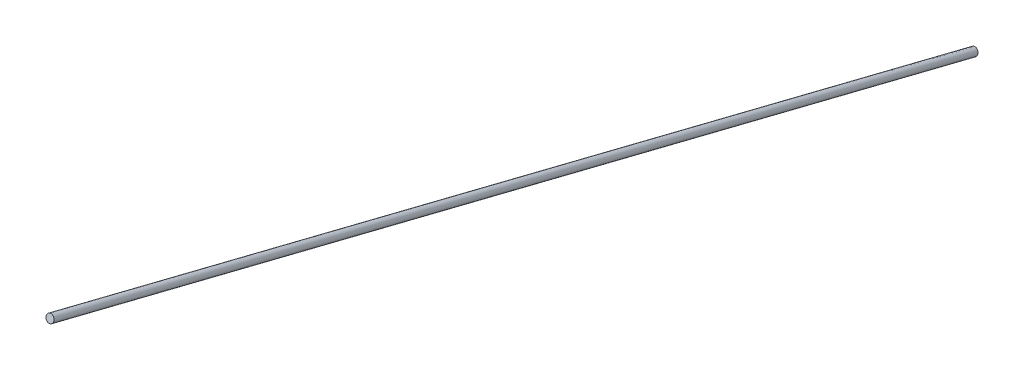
ISO-10303-21;
HEADER;
FILE_DESCRIPTION(('STEP AP214'),'2;1');
FILE_NAME('part.step','',(''),(''),'','','');
FILE_SCHEMA(('AUTOMOTIVE_DESIGN { 1 0 10303 214 1 1 1 1 }'));
ENDSEC;
DATA;
#1=APPLICATION_CONTEXT('core data for automotive mechanical design processes');
#2=APPLICATION_PROTOCOL_DEFINITION('international standard','automotive_design',2000,#1);
#3=PRODUCT_CONTEXT('',#1,'mechanical');
#4=PRODUCT('Part','Part','',(#3));
#5=PRODUCT_RELATED_PRODUCT_CATEGORY('part','',(#4));
#6=PRODUCT_DEFINITION_FORMATION('','',#4);
#7=PRODUCT_DEFINITION_CONTEXT('part definition',#1,'design');
#8=PRODUCT_DEFINITION('design','',#6,#7);
#9=PRODUCT_DEFINITION_SHAPE('','',#8);
#10=(LENGTH_UNIT() NAMED_UNIT(*) SI_UNIT(.MILLI.,.METRE.));
#11=(NAMED_UNIT(*) PLANE_ANGLE_UNIT() SI_UNIT($,.RADIAN.));
#12=(NAMED_UNIT(*) SI_UNIT($,.STERADIAN.) SOLID_ANGLE_UNIT());
#13=UNCERTAINTY_MEASURE_WITH_UNIT(LENGTH_MEASURE(1.E-05),#10,'distance_accuracy_value','');
#14=(GEOMETRIC_REPRESENTATION_CONTEXT(3) GLOBAL_UNCERTAINTY_ASSIGNED_CONTEXT((#13)) GLOBAL_UNIT_ASSIGNED_CONTEXT((#10,
#11,#12)) REPRESENTATION_CONTEXT('',''));
#15=CARTESIAN_POINT('',(0.,0.,0.));
#16=DIRECTION('',(0.,0.,1.));
#17=DIRECTION('',(1.,0.,0.));
#18=AXIS2_PLACEMENT_3D('',#15,#16,#17);
#19=CARTESIAN_POINT('',(0.3876059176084,22.03070653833,139.0767693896));
#20=DIRECTION('',(0.,0.242347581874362,0.970189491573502));
#21=DIRECTION('',(0.,0.970189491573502,-0.242347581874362));
#22=AXIS2_PLACEMENT_3D('',#19,#20,#21);
#23=PLANE('',#22);
#24=CARTESIAN_POINT('',(-1.63813020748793E-12,22.4067577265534,138.982834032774));
#25=DIRECTION('',(0.,0.242347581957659,0.970189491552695));
#26=DIRECTION('',(0.,-0.970189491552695,0.242347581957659));
#27=AXIS2_PLACEMENT_3D('',#24,#25,#26);
#28=CIRCLE('',#27,0.299999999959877);
#29=CARTESIAN_POINT('',(-1.63813020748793E-12,22.1157008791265,139.055538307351));
#30=VERTEX_POINT('',#29);
#31=EDGE_CURVE('E18',#30,#30,#28,.T.);
#32=ORIENTED_EDGE('',*,*,#31,.T.);
#33=EDGE_LOOP('',(#32));
#34=FACE_BOUND('',#33,.T.);
#35=ADVANCED_FACE('F14',(#34),#23,.T.);
#36=CARTESIAN_POINT('',(0.,4.7153842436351,68.1590011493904));
#37=DIRECTION('',(0.,0.242347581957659,0.970189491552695));
#38=DIRECTION('',(0.,-0.970189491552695,0.242347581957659));
#39=AXIS2_PLACEMENT_3D('',#36,#37,#38);
#40=CYLINDRICAL_SURFACE('',#39,0.299999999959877);
#41=ORIENTED_EDGE('',*,*,#31,.F.);
#42=EDGE_LOOP('',(#41));
#43=FACE_BOUND('',#42,.T.);
#44=CARTESIAN_POINT('',(0.,4.7153842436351,68.1590011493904));
#45=DIRECTION('',(0.,0.242347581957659,0.970189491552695));
#46=DIRECTION('',(0.,-0.970189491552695,0.242347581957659));
#47=AXIS2_PLACEMENT_3D('',#44,#45,#46);
#48=CIRCLE('',#47,0.299999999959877);
#49=CARTESIAN_POINT('',(0.,4.42432739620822,68.231705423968));
#50=VERTEX_POINT('',#49);
#51=EDGE_CURVE('E10',#50,#50,#48,.T.);
#52=ORIENTED_EDGE('',*,*,#51,.T.);
#53=EDGE_LOOP('',(#52));
#54=FACE_BOUND('',#53,.T.);
#55=ADVANCED_FACE('F28',(#43,#54),#40,.T.);
#56=CARTESIAN_POINT('',(0.3876059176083,4.339333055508,68.25293650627));
#57=DIRECTION('',(0.,0.242347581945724,0.970189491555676));
#58=DIRECTION('',(0.,0.970189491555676,-0.242347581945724));
#59=AXIS2_PLACEMENT_3D('',#56,#57,#58);
#60=PLANE('',#59);
#61=ORIENTED_EDGE('',*,*,#51,.F.);
#62=EDGE_LOOP('',(#61));
#63=FACE_BOUND('',#62,.T.);
#64=ADVANCED_FACE('F16',(#63),#60,.F.);
#65=CLOSED_SHELL('',(#35,#55,#64));
#66=MANIFOLD_SOLID_BREP('B1',#65);
#67=ADVANCED_BREP_SHAPE_REPRESENTATION('',(#18,#66),#14);
#68=SHAPE_DEFINITION_REPRESENTATION(#9,#67);
ENDSEC;
END-ISO-10303-21;
